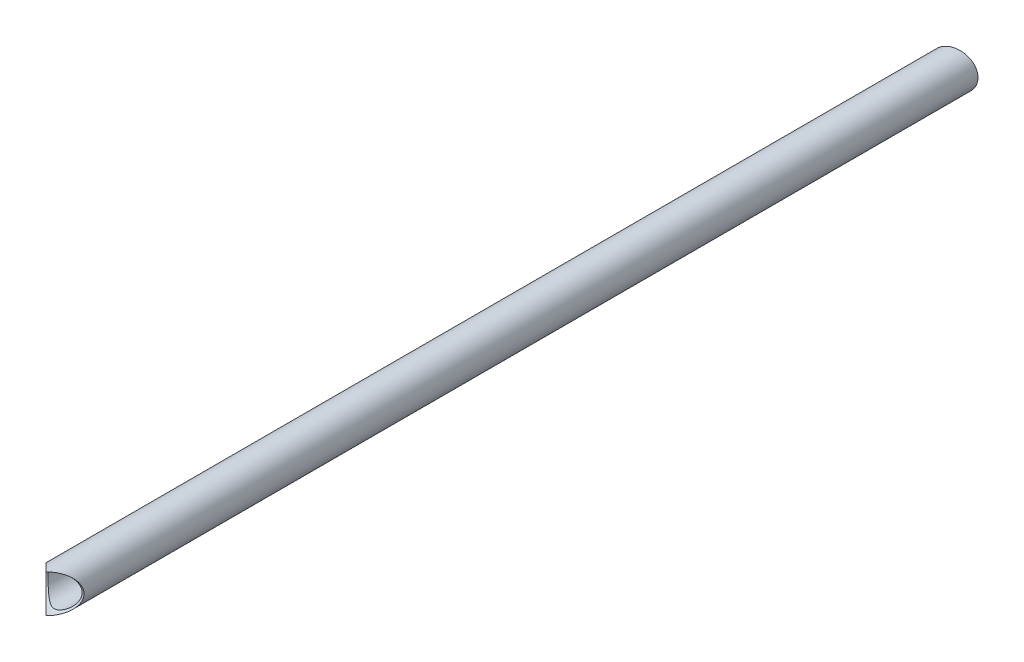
from build123d import *

# Parameters (mm, degrees)
SKIZZE2_R                            = 15
SKIZZE2_R_2                          = 13.5
AUFSATZ_LINEAR_AUSTRAGEN1_DEPTH      = 360
SKIZZE3_R                            = 15
SCHNITT_LINEAR_AUSTRAGEN1_DEPTH      = 20
SCHNITT_LINEAR_AUSTRAGEN2_DEPTH      = 361.624458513
SCHNITT_LINEAR_AUSTRAGEN2_DEPTH_BACK = 361.624458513


with BuildPart() as part:
    # Skizze2 → Aufsatz-Linear austragen1 (new, symmetric)
    with BuildSketch(Plane.XY):
        with Locations(Location((0, 0, 0), (0, 0, 180))):
            Circle(SKIZZE2_R)
        with Locations(Location((0, 0, 0), (0, 0, 180))):
            Circle(SKIZZE2_R_2, mode=Mode.SUBTRACT)
    extrude(amount=AUFSATZ_LINEAR_AUSTRAGEN1_DEPTH, both=True)

    # Skizze3 → Schnitt-Linear austragen1 (cut, symmetric)
    with BuildSketch(Plane(origin=(0, 0, 0), x_dir=(0, 0, -1), z_dir=(1, 0, 0))):
        with Locations((-360, 0)):
            Circle(SKIZZE3_R)
    extrude(amount=SCHNITT_LINEAR_AUSTRAGEN1_DEPTH, both=True, mode=Mode.SUBTRACT)

    # Skizze4 → Schnitt-Linear austragen2 (cut, two sides: drawn at the far end of the back side and taken through both)
    with BuildSketch(Plane(origin=(0, 0, 0), x_dir=(1, 0, 0), z_dir=(0, 1, 0)).offset(-SCHNITT_LINEAR_AUSTRAGEN2_DEPTH_BACK)):
        Polygon((1416.799332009, 735.610998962), (15, 360), (-15, 351.961524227), (-1416.799332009, -23.649474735), (-2168.021329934, 2779.949189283), (665.577334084, 3539.209662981), align=None)
    extrude(amount=SCHNITT_LINEAR_AUSTRAGEN2_DEPTH + SCHNITT_LINEAR_AUSTRAGEN2_DEPTH_BACK, mode=Mode.SUBTRACT)


solid = part.part
